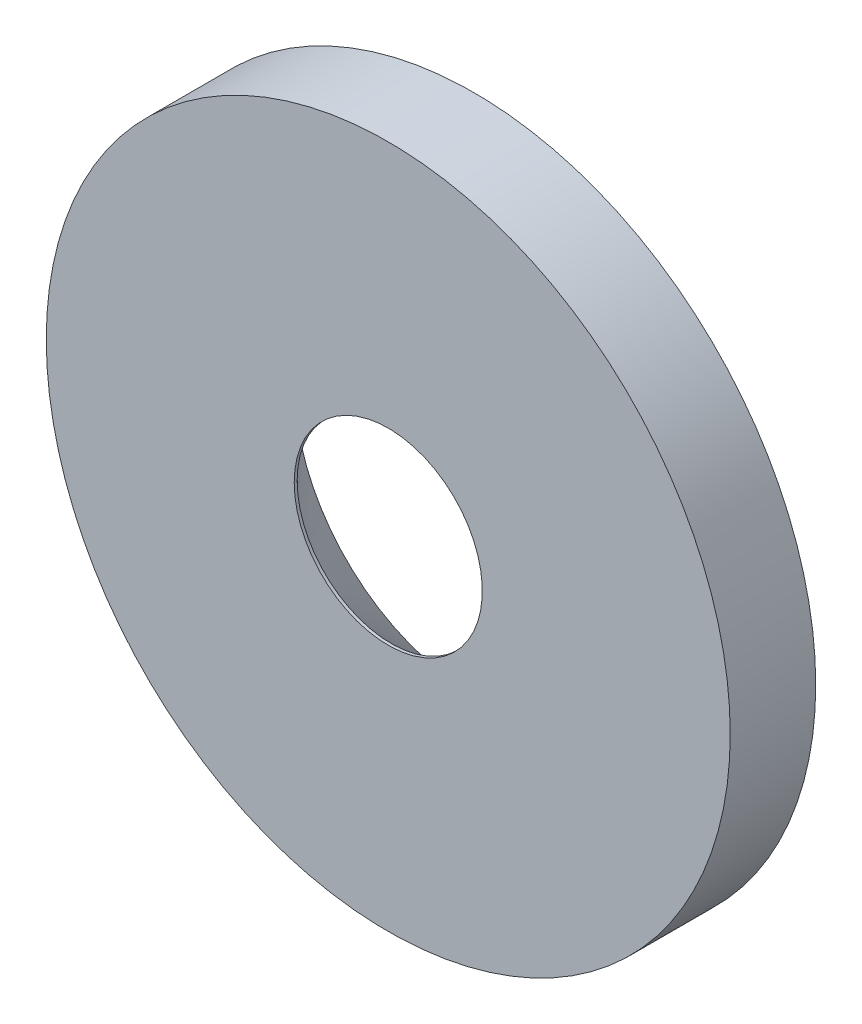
from build123d import *

# Parameters (mm, degrees)
ESQUISSE1_R = 12
BASE_DEPTH  = 3


with BuildPart() as part:
    # Esquisse1 → base (new body)
    with BuildSketch(Plane.XY):
        Circle(ESQUISSE1_R)
    extrude(amount=BASE_DEPTH)

    # Esquisse2 → Fraisage pour vis _ t_te frais_e _ fond (revolve, cut)
    with BuildSketch(Plane.YZ):
        Polygon((0, 0), (0, 3), (3.3, 3), (3.3, 2.897066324), (6.3, 0), align=None)
    revolve(axis=Axis((0, 0, -6.35), (0, 0, 1)), mode=Mode.SUBTRACT)


solid = part.part
